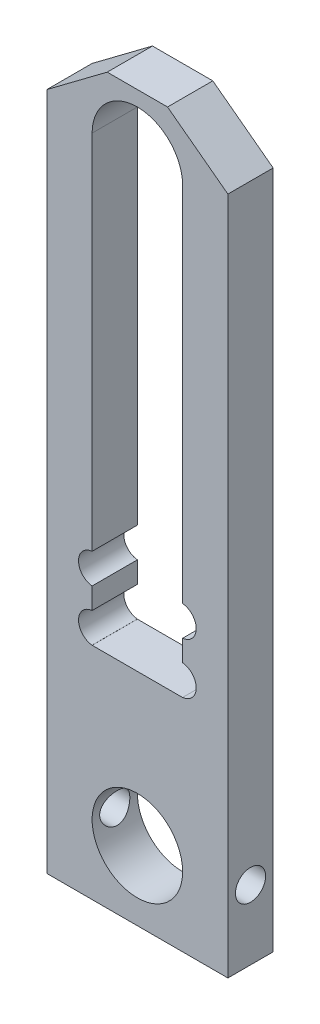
from build123d import *

# Parameters (mm, degrees)
BASE_EXTRUSION_DEPTH      = 7.5
BASE_EXTRUSION_DEPTH_BACK = 7.5
ESQUISSE1_R               = 15
ESQUISSE2_R               = 5
ENL_V_MAT_EXTRU_1_DEPTH   = 220.576865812
ESQUISSE3_R               = 5
ENL_V_MAT_EXTRU_2_DEPTH   = 226.267063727


with BuildPart() as part:
    # Esquisse1 → Base-Extrusion (new, two sides: drawn at the far end of the back side and taken through both)
    with BuildSketch(Plane.XY.offset(-BASE_EXTRUSION_DEPTH_BACK)):
        Polygon((10, 217), (-10, 217), (-30, 202), (-30, -23), (30, -23), (30, 202), align=None)
        Circle(ESQUISSE1_R, mode=Mode.SUBTRACT)
        with BuildLine():
            Line((-15, 50), (-15, 197))
            ThreePointArc((-15, 197), (0, 212), (15, 197))
            Line((15, 197), (15, 50))
            Line((15, 50), (-15, 50))
        make_face(mode=Mode.SUBTRACT)
    extrude(amount=BASE_EXTRUSION_DEPTH + BASE_EXTRUSION_DEPTH_BACK)

    # Esquisse2 → Enl_v. mat.-Extru.1 (cut, through all)
    with BuildSketch(Plane.XY.offset(7.5)):
        with Locations((-14.5, 72)):
            Circle(ESQUISSE2_R)
        with Locations((-14.5, 55)):
            Circle(ESQUISSE2_R)
    enl_v_mat_extru_1 = extrude(amount=-ENL_V_MAT_EXTRU_1_DEPTH, mode=Mode.SUBTRACT)

    # Sym_trie1: Enl_v. mat.-Extru.1 across plane
    add(enl_v_mat_extru_1.mirror(Plane(origin=(0, 0, 0), x_dir=(0, 0, 1), z_dir=(1, 0, 0))), mode=Mode.SUBTRACT)

    # Esquisse3 → Enl_v. mat.-Extru.2 (cut, through all)
    with BuildSketch(Plane(origin=(30, 0, 0), x_dir=(0, 0, -1), z_dir=(1, 0, 0))):
        with Locations(Location((0, 0, 0), (0, 0, 90))):
            Circle(ESQUISSE3_R)
    extrude(amount=-ENL_V_MAT_EXTRU_2_DEPTH, mode=Mode.SUBTRACT)


solid = part.part
